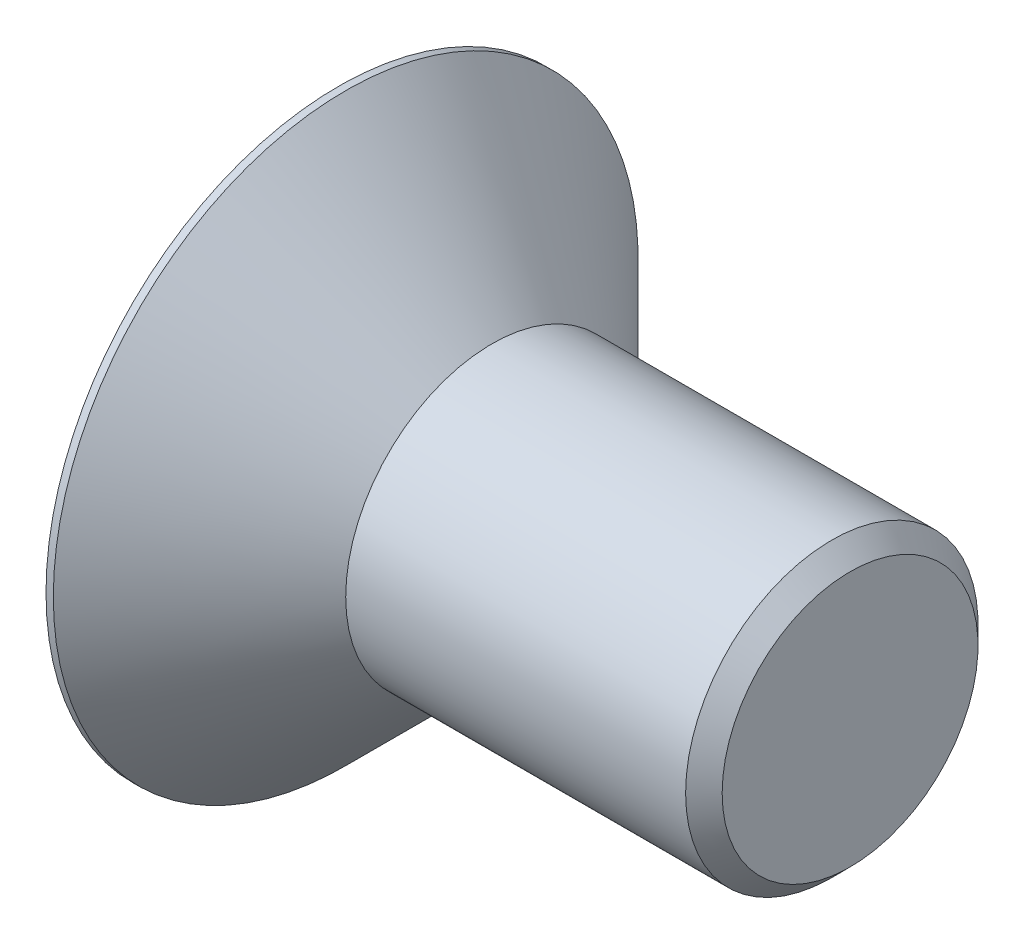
ISO-10303-21;
HEADER;
FILE_DESCRIPTION(('STEP AP214'),'2;1');
FILE_NAME('part.step','',(''),(''),'','','');
FILE_SCHEMA(('AUTOMOTIVE_DESIGN { 1 0 10303 214 1 1 1 1 }'));
ENDSEC;
DATA;
#1=APPLICATION_CONTEXT('core data for automotive mechanical design processes');
#2=APPLICATION_PROTOCOL_DEFINITION('international standard','automotive_design',2000,#1);
#3=PRODUCT_CONTEXT('',#1,'mechanical');
#4=PRODUCT('Part','Part','',(#3));
#5=PRODUCT_RELATED_PRODUCT_CATEGORY('part','',(#4));
#6=PRODUCT_DEFINITION_FORMATION('','',#4);
#7=PRODUCT_DEFINITION_CONTEXT('part definition',#1,'design');
#8=PRODUCT_DEFINITION('design','',#6,#7);
#9=PRODUCT_DEFINITION_SHAPE('','',#8);
#10=(LENGTH_UNIT() NAMED_UNIT(*) SI_UNIT(.MILLI.,.METRE.));
#11=(NAMED_UNIT(*) PLANE_ANGLE_UNIT() SI_UNIT($,.RADIAN.));
#12=(NAMED_UNIT(*) SI_UNIT($,.STERADIAN.) SOLID_ANGLE_UNIT());
#13=UNCERTAINTY_MEASURE_WITH_UNIT(LENGTH_MEASURE(1.E-05),#10,'distance_accuracy_value','');
#14=(GEOMETRIC_REPRESENTATION_CONTEXT(3) GLOBAL_UNCERTAINTY_ASSIGNED_CONTEXT((#13)) GLOBAL_UNIT_ASSIGNED_CONTEXT((#10,
#11,#12)) REPRESENTATION_CONTEXT('',''));
#15=CARTESIAN_POINT('',(0.,0.,0.));
#16=DIRECTION('',(0.,0.,1.));
#17=DIRECTION('',(1.,0.,0.));
#18=AXIS2_PLACEMENT_3D('',#15,#16,#17);
#19=CARTESIAN_POINT('',(0.,0.,0.));
#20=DIRECTION('',(1.,0.,0.));
#21=DIRECTION('',(0.,0.,-1.));
#22=AXIS2_PLACEMENT_3D('',#19,#20,#21);
#23=PLANE('',#22);
#24=DIRECTION('',(0.,0.407964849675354,-0.912997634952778));
#25=VECTOR('',#24,1.);
#26=CARTESIAN_POINT('',(0.,1.69364754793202,2.33771069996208));
#27=LINE('',#26,#25);
#28=CARTESIAN_POINT('',(0.,1.69364754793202,2.33771069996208));
#29=VERTEX_POINT('',#28);
#30=CARTESIAN_POINT('',(0.,2.87134062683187,-0.297886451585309));
#31=VERTEX_POINT('',#30);
#32=EDGE_CURVE('E124',#29,#31,#27,.T.);
#33=ORIENTED_EDGE('',*,*,#32,.F.);
#34=DIRECTION('',(0.,0.994661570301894,-0.103190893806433));
#35=VECTOR('',#34,1.);
#36=CARTESIAN_POINT('',(0.,-1.17769307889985,2.63559715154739));
#37=LINE('',#36,#35);
#38=CARTESIAN_POINT('',(0.,-1.17769307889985,2.63559715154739));
#39=VERTEX_POINT('',#38);
#40=EDGE_CURVE('E50',#39,#29,#37,.T.);
#41=ORIENTED_EDGE('',*,*,#40,.F.);
#42=DIRECTION('',(0.,0.58669672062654,0.809806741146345));
#43=VECTOR('',#42,1.);
#44=CARTESIAN_POINT('',(0.,-2.87134062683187,0.29788645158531));
#45=LINE('',#44,#43);
#46=CARTESIAN_POINT('',(0.,-2.87134062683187,0.29788645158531));
#47=VERTEX_POINT('',#46);
#48=EDGE_CURVE('E133',#47,#39,#45,.T.);
#49=ORIENTED_EDGE('',*,*,#48,.F.);
#50=DIRECTION('',(0.,-0.407964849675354,0.912997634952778));
#51=VECTOR('',#50,1.);
#52=CARTESIAN_POINT('',(0.,-1.69364754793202,-2.33771069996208));
#53=LINE('',#52,#51);
#54=CARTESIAN_POINT('',(0.,-1.69364754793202,-2.33771069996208));
#55=VERTEX_POINT('',#54);
#56=EDGE_CURVE('E131',#55,#47,#53,.T.);
#57=ORIENTED_EDGE('',*,*,#56,.F.);
#58=DIRECTION('',(0.,-0.994661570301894,0.103190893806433));
#59=VECTOR('',#58,1.);
#60=CARTESIAN_POINT('',(0.,1.17769307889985,-2.63559715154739));
#61=LINE('',#60,#59);
#62=CARTESIAN_POINT('',(0.,1.17769307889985,-2.63559715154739));
#63=VERTEX_POINT('',#62);
#64=EDGE_CURVE('E98',#63,#55,#61,.T.);
#65=ORIENTED_EDGE('',*,*,#64,.F.);
#66=DIRECTION('',(0.,-0.58669672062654,-0.809806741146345));
#67=VECTOR('',#66,1.);
#68=CARTESIAN_POINT('',(0.,2.87134062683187,-0.297886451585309));
#69=LINE('',#68,#67);
#70=EDGE_CURVE('E127',#31,#63,#69,.T.);
#71=ORIENTED_EDGE('',*,*,#70,.F.);
#72=EDGE_LOOP('',(#33,#41,#49,#57,#65,#71));
#73=FACE_BOUND('',#72,.T.);
#74=CARTESIAN_POINT('',(0.,0.,0.));
#75=DIRECTION('',(-1.,0.,0.));
#76=DIRECTION('',(0.,0.,1.));
#77=AXIS2_PLACEMENT_3D('',#74,#75,#76);
#78=CIRCLE('',#77,8.);
#79=CARTESIAN_POINT('',(0.,0.,8.));
#80=VERTEX_POINT('',#79);
#81=EDGE_CURVE('E148',#80,#80,#78,.T.);
#82=ORIENTED_EDGE('',*,*,#81,.T.);
#83=EDGE_LOOP('',(#82));
#84=FACE_BOUND('',#83,.T.);
#85=ADVANCED_FACE('F35',(#73,#84),#23,.F.);
#86=CARTESIAN_POINT('',(0.,0.,0.));
#87=DIRECTION('',(-1.,0.,0.));
#88=DIRECTION('',(0.,0.,1.));
#89=AXIS2_PLACEMENT_3D('',#86,#87,#88);
#90=CYLINDRICAL_SURFACE('',#89,8.);
#91=ORIENTED_EDGE('',*,*,#81,.F.);
#92=EDGE_LOOP('',(#91));
#93=FACE_BOUND('',#92,.T.);
#94=CARTESIAN_POINT('',(0.200000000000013,0.,0.));
#95=DIRECTION('',(-1.,0.,0.));
#96=DIRECTION('',(0.,0.,1.));
#97=AXIS2_PLACEMENT_3D('',#94,#95,#96);
#98=CIRCLE('',#97,8.);
#99=CARTESIAN_POINT('',(0.200000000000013,0.,8.));
#100=VERTEX_POINT('',#99);
#101=EDGE_CURVE('E145',#100,#100,#98,.T.);
#102=ORIENTED_EDGE('',*,*,#101,.T.);
#103=EDGE_LOOP('',(#102));
#104=FACE_BOUND('',#103,.T.);
#105=ADVANCED_FACE('F170',(#93,#104),#90,.T.);
#106=CARTESIAN_POINT('',(4.2,0.,0.));
#107=DIRECTION('',(-1.,0.,0.));
#108=DIRECTION('',(0.,0.,1.));
#109=AXIS2_PLACEMENT_3D('',#106,#107,#108);
#110=CONICAL_SURFACE('',#109,4.,0.78539816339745);
#111=ORIENTED_EDGE('',*,*,#101,.F.);
#112=EDGE_LOOP('',(#111));
#113=FACE_BOUND('',#112,.T.);
#114=CARTESIAN_POINT('',(4.2,0.,0.));
#115=DIRECTION('',(-1.,0.,0.));
#116=DIRECTION('',(0.,0.,1.));
#117=AXIS2_PLACEMENT_3D('',#114,#115,#116);
#118=CIRCLE('',#117,4.);
#119=CARTESIAN_POINT('',(4.2,0.,4.));
#120=VERTEX_POINT('',#119);
#121=EDGE_CURVE('E137',#120,#120,#118,.T.);
#122=ORIENTED_EDGE('',*,*,#121,.T.);
#123=EDGE_LOOP('',(#122));
#124=FACE_BOUND('',#123,.T.);
#125=ADVANCED_FACE('F175',(#113,#124),#110,.T.);
#126=CARTESIAN_POINT('',(0.,0.,0.));
#127=DIRECTION('',(-1.,0.,0.));
#128=DIRECTION('',(0.,0.,1.));
#129=AXIS2_PLACEMENT_3D('',#126,#127,#128);
#130=CYLINDRICAL_SURFACE('',#129,4.);
#131=CARTESIAN_POINT('',(13.5,0.,0.));
#132=DIRECTION('',(-1.,0.,0.));
#133=DIRECTION('',(0.,0.,1.));
#134=AXIS2_PLACEMENT_3D('',#131,#132,#133);
#135=CIRCLE('',#134,4.);
#136=CARTESIAN_POINT('',(13.5,0.,4.));
#137=VERTEX_POINT('',#136);
#138=EDGE_CURVE('E43',#137,#137,#135,.T.);
#139=ORIENTED_EDGE('',*,*,#138,.T.);
#140=EDGE_LOOP('',(#139));
#141=FACE_BOUND('',#140,.T.);
#142=ORIENTED_EDGE('',*,*,#121,.F.);
#143=EDGE_LOOP('',(#142));
#144=FACE_BOUND('',#143,.T.);
#145=ADVANCED_FACE('F153',(#141,#144),#130,.T.);
#146=CARTESIAN_POINT('',(14.,4.,0.));
#147=DIRECTION('',(-1.,0.,0.));
#148=DIRECTION('',(0.,0.,1.));
#149=AXIS2_PLACEMENT_3D('',#146,#147,#148);
#150=PLANE('',#149);
#151=CARTESIAN_POINT('',(14.,0.,0.));
#152=DIRECTION('',(-1.,0.,0.));
#153=DIRECTION('',(0.,0.,1.));
#154=AXIS2_PLACEMENT_3D('',#151,#152,#153);
#155=CIRCLE('',#154,3.50000000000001);
#156=CARTESIAN_POINT('',(14.,0.,3.50000000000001));
#157=VERTEX_POINT('',#156);
#158=EDGE_CURVE('E11',#157,#157,#155,.F.);
#159=ORIENTED_EDGE('',*,*,#158,.T.);
#160=EDGE_LOOP('',(#159));
#161=FACE_BOUND('',#160,.T.);
#162=ADVANCED_FACE('F158',(#161),#150,.F.);
#163=CARTESIAN_POINT('',(13.5,0.,0.));
#164=DIRECTION('',(-1.,0.,0.));
#165=DIRECTION('',(0.,0.,1.));
#166=AXIS2_PLACEMENT_3D('',#163,#164,#165);
#167=CONICAL_SURFACE('',#166,4.,0.785398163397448);
#168=ORIENTED_EDGE('',*,*,#158,.F.);
#169=EDGE_LOOP('',(#168));
#170=FACE_BOUND('',#169,.T.);
#171=ORIENTED_EDGE('',*,*,#138,.F.);
#172=EDGE_LOOP('',(#171));
#173=FACE_BOUND('',#172,.T.);
#174=ADVANCED_FACE('F37',(#170,#173),#167,.T.);
#175=CARTESIAN_POINT('',(2.5,-1.17769307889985,2.63559715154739));
#176=DIRECTION('',(0.,0.103190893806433,0.994661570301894));
#177=DIRECTION('',(0.,-0.994661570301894,0.103190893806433));
#178=AXIS2_PLACEMENT_3D('',#175,#176,#177);
#179=PLANE('',#178);
#180=ORIENTED_EDGE('',*,*,#40,.T.);
#181=DIRECTION('',(-1.,0.,0.));
#182=VECTOR('',#181,1.);
#183=CARTESIAN_POINT('',(2.5,1.69364754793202,2.33771069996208));
#184=LINE('',#183,#182);
#185=CARTESIAN_POINT('',(2.5,1.69364754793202,2.33771069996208));
#186=VERTEX_POINT('',#185);
#187=EDGE_CURVE('E80',#186,#29,#184,.T.);
#188=ORIENTED_EDGE('',*,*,#187,.F.);
#189=DIRECTION('',(0.,0.994661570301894,-0.103190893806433));
#190=VECTOR('',#189,1.);
#191=CARTESIAN_POINT('',(2.5,-1.17769307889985,2.63559715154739));
#192=LINE('',#191,#190);
#193=CARTESIAN_POINT('',(2.5,-1.17769307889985,2.63559715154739));
#194=VERTEX_POINT('',#193);
#195=EDGE_CURVE('E135',#194,#186,#192,.T.);
#196=ORIENTED_EDGE('',*,*,#195,.F.);
#197=DIRECTION('',(-1.,0.,0.));
#198=VECTOR('',#197,1.);
#199=CARTESIAN_POINT('',(2.5,-1.17769307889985,2.63559715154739));
#200=LINE('',#199,#198);
#201=EDGE_CURVE('E58',#194,#39,#200,.T.);
#202=ORIENTED_EDGE('',*,*,#201,.T.);
#203=EDGE_LOOP('',(#180,#188,#196,#202));
#204=FACE_BOUND('',#203,.T.);
#205=ADVANCED_FACE('F157',(#204),#179,.F.);
#206=CARTESIAN_POINT('',(2.5,-2.87134062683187,0.29788645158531));
#207=DIRECTION('',(0.,-0.809806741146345,0.58669672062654));
#208=DIRECTION('',(0.,-0.58669672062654,-0.809806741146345));
#209=AXIS2_PLACEMENT_3D('',#206,#207,#208);
#210=PLANE('',#209);
#211=ORIENTED_EDGE('',*,*,#48,.T.);
#212=ORIENTED_EDGE('',*,*,#201,.F.);
#213=DIRECTION('',(0.,0.58669672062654,0.809806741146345));
#214=VECTOR('',#213,1.);
#215=CARTESIAN_POINT('',(2.5,-2.87134062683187,0.29788645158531));
#216=LINE('',#215,#214);
#217=CARTESIAN_POINT('',(2.5,-2.87134062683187,0.29788645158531));
#218=VERTEX_POINT('',#217);
#219=EDGE_CURVE('E110',#218,#194,#216,.T.);
#220=ORIENTED_EDGE('',*,*,#219,.F.);
#221=DIRECTION('',(-1.,0.,0.));
#222=VECTOR('',#221,1.);
#223=CARTESIAN_POINT('',(2.5,-2.87134062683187,0.29788645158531));
#224=LINE('',#223,#222);
#225=EDGE_CURVE('E102',#218,#47,#224,.T.);
#226=ORIENTED_EDGE('',*,*,#225,.T.);
#227=EDGE_LOOP('',(#211,#212,#220,#226));
#228=FACE_BOUND('',#227,.T.);
#229=ADVANCED_FACE('F164',(#228),#210,.F.);
#230=CARTESIAN_POINT('',(2.5,-1.69364754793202,-2.33771069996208));
#231=DIRECTION('',(0.,-0.912997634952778,-0.407964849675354));
#232=DIRECTION('',(0.,0.407964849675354,-0.912997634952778));
#233=AXIS2_PLACEMENT_3D('',#230,#231,#232);
#234=PLANE('',#233);
#235=ORIENTED_EDGE('',*,*,#56,.T.);
#236=ORIENTED_EDGE('',*,*,#225,.F.);
#237=DIRECTION('',(0.,-0.407964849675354,0.912997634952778));
#238=VECTOR('',#237,1.);
#239=CARTESIAN_POINT('',(2.5,-1.69364754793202,-2.33771069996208));
#240=LINE('',#239,#238);
#241=CARTESIAN_POINT('',(2.5,-1.69364754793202,-2.33771069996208));
#242=VERTEX_POINT('',#241);
#243=EDGE_CURVE('E106',#242,#218,#240,.T.);
#244=ORIENTED_EDGE('',*,*,#243,.F.);
#245=DIRECTION('',(-1.,0.,0.));
#246=VECTOR('',#245,1.);
#247=CARTESIAN_POINT('',(2.5,-1.69364754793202,-2.33771069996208));
#248=LINE('',#247,#246);
#249=EDGE_CURVE('E91',#242,#55,#248,.T.);
#250=ORIENTED_EDGE('',*,*,#249,.T.);
#251=EDGE_LOOP('',(#235,#236,#244,#250));
#252=FACE_BOUND('',#251,.T.);
#253=ADVANCED_FACE('F107',(#252),#234,.F.);
#254=CARTESIAN_POINT('',(2.5,1.17769307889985,-2.63559715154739));
#255=DIRECTION('',(0.,-0.103190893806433,-0.994661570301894));
#256=DIRECTION('',(0.,0.994661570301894,-0.103190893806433));
#257=AXIS2_PLACEMENT_3D('',#254,#255,#256);
#258=PLANE('',#257);
#259=ORIENTED_EDGE('',*,*,#64,.T.);
#260=ORIENTED_EDGE('',*,*,#249,.F.);
#261=DIRECTION('',(0.,-0.994661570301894,0.103190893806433));
#262=VECTOR('',#261,1.);
#263=CARTESIAN_POINT('',(2.5,1.17769307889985,-2.63559715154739));
#264=LINE('',#263,#262);
#265=CARTESIAN_POINT('',(2.5,1.17769307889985,-2.63559715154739));
#266=VERTEX_POINT('',#265);
#267=EDGE_CURVE('E95',#266,#242,#264,.T.);
#268=ORIENTED_EDGE('',*,*,#267,.F.);
#269=DIRECTION('',(-1.,0.,0.));
#270=VECTOR('',#269,1.);
#271=CARTESIAN_POINT('',(2.5,1.17769307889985,-2.63559715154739));
#272=LINE('',#271,#270);
#273=EDGE_CURVE('E103',#266,#63,#272,.T.);
#274=ORIENTED_EDGE('',*,*,#273,.T.);
#275=EDGE_LOOP('',(#259,#260,#268,#274));
#276=FACE_BOUND('',#275,.T.);
#277=ADVANCED_FACE('F93',(#276),#258,.F.);
#278=CARTESIAN_POINT('',(2.5,2.87134062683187,-0.297886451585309));
#279=DIRECTION('',(0.,0.809806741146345,-0.58669672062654));
#280=DIRECTION('',(0.,0.58669672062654,0.809806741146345));
#281=AXIS2_PLACEMENT_3D('',#278,#279,#280);
#282=PLANE('',#281);
#283=ORIENTED_EDGE('',*,*,#70,.T.);
#284=ORIENTED_EDGE('',*,*,#273,.F.);
#285=DIRECTION('',(0.,-0.58669672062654,-0.809806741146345));
#286=VECTOR('',#285,1.);
#287=CARTESIAN_POINT('',(2.5,2.87134062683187,-0.297886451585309));
#288=LINE('',#287,#286);
#289=CARTESIAN_POINT('',(2.5,2.87134062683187,-0.297886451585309));
#290=VERTEX_POINT('',#289);
#291=EDGE_CURVE('E116',#290,#266,#288,.T.);
#292=ORIENTED_EDGE('',*,*,#291,.F.);
#293=DIRECTION('',(-1.,0.,0.));
#294=VECTOR('',#293,1.);
#295=CARTESIAN_POINT('',(2.5,2.87134062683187,-0.297886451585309));
#296=LINE('',#295,#294);
#297=EDGE_CURVE('E140',#290,#31,#296,.T.);
#298=ORIENTED_EDGE('',*,*,#297,.T.);
#299=EDGE_LOOP('',(#283,#284,#292,#298));
#300=FACE_BOUND('',#299,.T.);
#301=ADVANCED_FACE('F189',(#300),#282,.F.);
#302=CARTESIAN_POINT('',(2.5,1.69364754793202,2.33771069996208));
#303=DIRECTION('',(0.,0.912997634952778,0.407964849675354));
#304=DIRECTION('',(0.,-0.407964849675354,0.912997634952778));
#305=AXIS2_PLACEMENT_3D('',#302,#303,#304);
#306=PLANE('',#305);
#307=ORIENTED_EDGE('',*,*,#32,.T.);
#308=ORIENTED_EDGE('',*,*,#297,.F.);
#309=DIRECTION('',(0.,0.407964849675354,-0.912997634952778));
#310=VECTOR('',#309,1.);
#311=CARTESIAN_POINT('',(2.5,1.69364754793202,2.33771069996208));
#312=LINE('',#311,#310);
#313=EDGE_CURVE('E118',#186,#290,#312,.T.);
#314=ORIENTED_EDGE('',*,*,#313,.F.);
#315=ORIENTED_EDGE('',*,*,#187,.T.);
#316=EDGE_LOOP('',(#307,#308,#314,#315));
#317=FACE_BOUND('',#316,.T.);
#318=ADVANCED_FACE('F186',(#317),#306,.F.);
#319=CARTESIAN_POINT('',(2.5,0.,0.));
#320=DIRECTION('',(-1.,0.,0.));
#321=DIRECTION('',(0.,0.,1.));
#322=AXIS2_PLACEMENT_3D('',#319,#320,#321);
#323=PLANE('',#322);
#324=ORIENTED_EDGE('',*,*,#195,.T.);
#325=ORIENTED_EDGE('',*,*,#313,.T.);
#326=ORIENTED_EDGE('',*,*,#291,.T.);
#327=ORIENTED_EDGE('',*,*,#267,.T.);
#328=ORIENTED_EDGE('',*,*,#243,.T.);
#329=ORIENTED_EDGE('',*,*,#219,.T.);
#330=EDGE_LOOP('',(#324,#325,#326,#327,#328,#329));
#331=FACE_BOUND('',#330,.T.);
#332=ADVANCED_FACE('F113',(#331),#323,.T.);
#333=CLOSED_SHELL('',(#85,#105,#125,#145,#162,#174,#205,#229,#253,#277,#301,#318,#332));
#334=MANIFOLD_SOLID_BREP('B2',#333);
#335=ADVANCED_BREP_SHAPE_REPRESENTATION('',(#18,#334),#14);
#336=SHAPE_DEFINITION_REPRESENTATION(#9,#335);
ENDSEC;
END-ISO-10303-21;
